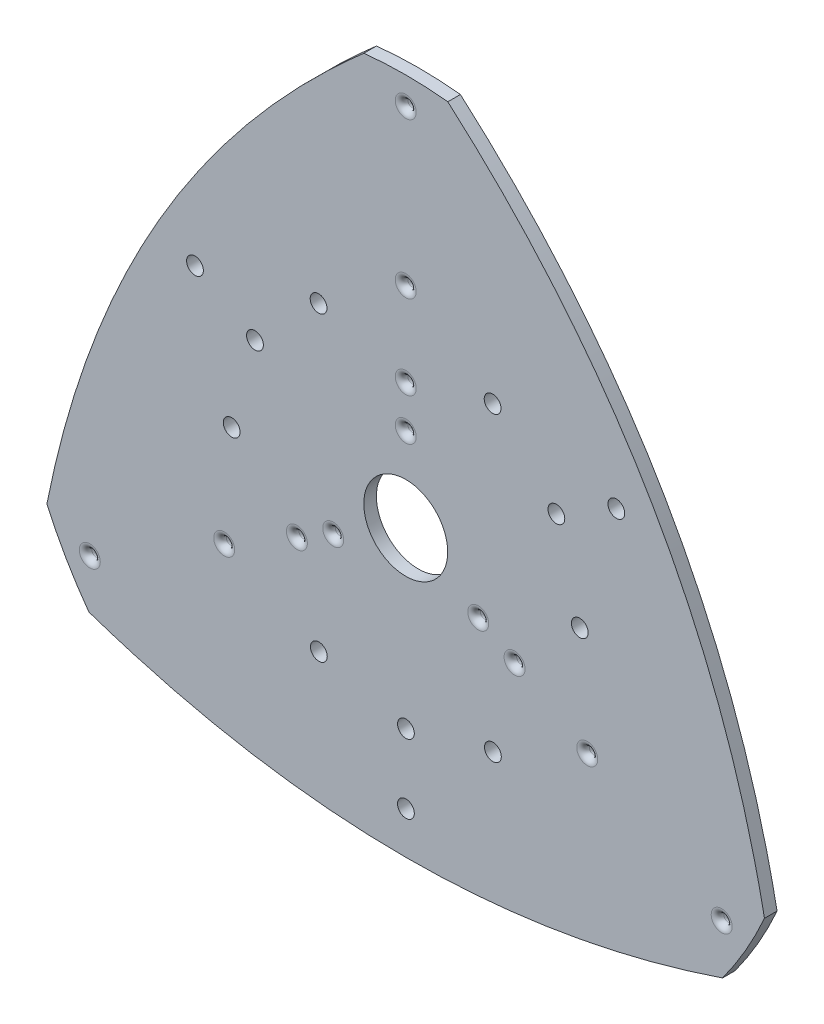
ISO-10303-21;
HEADER;
FILE_DESCRIPTION(('STEP AP214'),'2;1');
FILE_NAME('part.step','',(''),(''),'','','');
FILE_SCHEMA(('AUTOMOTIVE_DESIGN { 1 0 10303 214 1 1 1 1 }'));
ENDSEC;
DATA;
#1=APPLICATION_CONTEXT('core data for automotive mechanical design processes');
#2=APPLICATION_PROTOCOL_DEFINITION('international standard','automotive_design',2000,#1);
#3=PRODUCT_CONTEXT('',#1,'mechanical');
#4=PRODUCT('Part','Part','',(#3));
#5=PRODUCT_RELATED_PRODUCT_CATEGORY('part','',(#4));
#6=PRODUCT_DEFINITION_FORMATION('','',#4);
#7=PRODUCT_DEFINITION_CONTEXT('part definition',#1,'design');
#8=PRODUCT_DEFINITION('design','',#6,#7);
#9=PRODUCT_DEFINITION_SHAPE('','',#8);
#10=(LENGTH_UNIT() NAMED_UNIT(*) SI_UNIT(.MILLI.,.METRE.));
#11=(NAMED_UNIT(*) PLANE_ANGLE_UNIT() SI_UNIT($,.RADIAN.));
#12=(NAMED_UNIT(*) SI_UNIT($,.STERADIAN.) SOLID_ANGLE_UNIT());
#13=UNCERTAINTY_MEASURE_WITH_UNIT(LENGTH_MEASURE(1.E-05),#10,'distance_accuracy_value','');
#14=(GEOMETRIC_REPRESENTATION_CONTEXT(3) GLOBAL_UNCERTAINTY_ASSIGNED_CONTEXT((#13)) GLOBAL_UNIT_ASSIGNED_CONTEXT((#10,
#11,#12)) REPRESENTATION_CONTEXT('',''));
#15=CARTESIAN_POINT('',(0.,0.,0.));
#16=DIRECTION('',(0.,0.,1.));
#17=DIRECTION('',(1.,0.,0.));
#18=AXIS2_PLACEMENT_3D('',#15,#16,#17);
#19=CARTESIAN_POINT('',(-85.5202987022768,-37.8415178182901,3.));
#20=CARTESIAN_POINT('',(-70.011431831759,40.3956988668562,3.));
#21=CARTESIAN_POINT('',(-9.98569138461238,92.919602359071,3.));
#22=B_SPLINE_CURVE_WITH_KNOTS('',2,(#19,#20,#21),.UNSPECIFIED.,.F.,.F.,(3,3),(0.,1.),.UNSPECIFIED.);
#23=DIRECTION('',(0.,0.,-1.));
#24=VECTOR('',#23,1.);
#25=SURFACE_OF_LINEAR_EXTRUSION('',#22,#24);
#26=CARTESIAN_POINT('',(-85.5202987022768,-37.8415178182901,0.));
#27=CARTESIAN_POINT('',(-70.011431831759,40.3956988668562,0.));
#28=CARTESIAN_POINT('',(-9.98569138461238,92.919602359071,0.));
#29=B_SPLINE_CURVE_WITH_KNOTS('',2,(#26,#27,#28),.UNSPECIFIED.,.F.,.F.,(3,3),(0.,1.),.UNSPECIFIED.);
#30=CARTESIAN_POINT('',(-85.5202987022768,-37.8415178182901,0.));
#31=VERTEX_POINT('',#30);
#32=CARTESIAN_POINT('',(-9.98569138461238,92.919602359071,0.));
#33=VERTEX_POINT('',#32);
#34=EDGE_CURVE('E248',#31,#33,#29,.T.);
#35=ORIENTED_EDGE('',*,*,#34,.F.);
#36=DIRECTION('',(0.,0.,-1.));
#37=VECTOR('',#36,1.);
#38=CARTESIAN_POINT('',(-85.5202987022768,-37.8415178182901,3.));
#39=LINE('',#38,#37);
#40=CARTESIAN_POINT('',(-85.5202987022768,-37.8415178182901,3.));
#41=VERTEX_POINT('',#40);
#42=EDGE_CURVE('E95',#41,#31,#39,.T.);
#43=ORIENTED_EDGE('',*,*,#42,.F.);
#44=CARTESIAN_POINT('',(-9.98569138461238,92.919602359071,3.));
#45=VERTEX_POINT('',#44);
#46=EDGE_CURVE('E158',#41,#45,#22,.T.);
#47=ORIENTED_EDGE('',*,*,#46,.T.);
#48=DIRECTION('',(0.,0.,-1.));
#49=VECTOR('',#48,1.);
#50=CARTESIAN_POINT('',(-9.98569138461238,92.919602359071,3.));
#51=LINE('',#50,#49);
#52=EDGE_CURVE('E91',#45,#33,#51,.T.);
#53=ORIENTED_EDGE('',*,*,#52,.T.);
#54=EDGE_LOOP('',(#35,#43,#47,#53));
#55=FACE_BOUND('',#54,.T.);
#56=ADVANCED_FACE('F43',(#55),#25,.T.);
#57=CARTESIAN_POINT('',(0.,-0.0456382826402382,3.));
#58=DIRECTION('',(0.,0.,-1.));
#59=DIRECTION('',(-1.,0.,0.));
#60=AXIS2_PLACEMENT_3D('',#57,#58,#59);
#61=CYLINDRICAL_SURFACE('',#60,93.5);
#62=CARTESIAN_POINT('',(0.,-0.0456382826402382,0.));
#63=DIRECTION('',(0.,0.,1.));
#64=DIRECTION('',(1.,0.,0.));
#65=AXIS2_PLACEMENT_3D('',#62,#63,#64);
#66=CIRCLE('',#65,93.5);
#67=CARTESIAN_POINT('',(-75.5174143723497,-55.176121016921,0.));
#68=VERTEX_POINT('',#67);
#69=EDGE_CURVE('E420',#31,#68,#66,.T.);
#70=ORIENTED_EDGE('',*,*,#69,.T.);
#71=DIRECTION('',(0.,0.,-1.));
#72=VECTOR('',#71,1.);
#73=CARTESIAN_POINT('',(-75.5174143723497,-55.176121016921,3.));
#74=LINE('',#73,#72);
#75=CARTESIAN_POINT('',(-75.5174143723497,-55.176121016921,3.));
#76=VERTEX_POINT('',#75);
#77=EDGE_CURVE('E168',#76,#68,#74,.T.);
#78=ORIENTED_EDGE('',*,*,#77,.F.);
#79=CARTESIAN_POINT('',(0.,-0.0456382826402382,3.));
#80=DIRECTION('',(0.,0.,1.));
#81=DIRECTION('',(1.,0.,0.));
#82=AXIS2_PLACEMENT_3D('',#79,#80,#81);
#83=CIRCLE('',#82,93.5);
#84=EDGE_CURVE('E115',#41,#76,#83,.T.);
#85=ORIENTED_EDGE('',*,*,#84,.F.);
#86=ORIENTED_EDGE('',*,*,#42,.T.);
#87=EDGE_LOOP('',(#70,#78,#85,#86));
#88=FACE_BOUND('',#87,.T.);
#89=ADVANCED_FACE('F151',(#88),#61,.T.);
#90=CARTESIAN_POINT('',(75.4923411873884,-55.2104497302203,3.));
#91=CARTESIAN_POINT('',(-0.017509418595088,-80.8979853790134,3.));
#92=CARTESIAN_POINT('',(-75.5174143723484,-55.1761210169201,3.));
#93=B_SPLINE_CURVE_WITH_KNOTS('',2,(#90,#91,#92),.UNSPECIFIED.,.F.,.F.,(3,3),(0.,1.),.UNSPECIFIED.);
#94=DIRECTION('',(0.,0.,-1.));
#95=VECTOR('',#94,1.);
#96=SURFACE_OF_LINEAR_EXTRUSION('',#93,#95);
#97=CARTESIAN_POINT('',(75.4923411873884,-55.2104497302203,0.));
#98=CARTESIAN_POINT('',(-0.017509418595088,-80.8979853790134,0.));
#99=CARTESIAN_POINT('',(-75.5174143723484,-55.1761210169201,0.));
#100=B_SPLINE_CURVE_WITH_KNOTS('',2,(#97,#98,#99),.UNSPECIFIED.,.F.,.F.,(3,3),(0.,1.),.UNSPECIFIED.);
#101=CARTESIAN_POINT('',(75.4923411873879,-55.2104497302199,0.));
#102=VERTEX_POINT('',#101);
#103=EDGE_CURVE('E171',#102,#68,#100,.T.);
#104=ORIENTED_EDGE('',*,*,#103,.F.);
#105=DIRECTION('',(0.,0.,-1.));
#106=VECTOR('',#105,1.);
#107=CARTESIAN_POINT('',(75.4923411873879,-55.2104497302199,3.));
#108=LINE('',#107,#106);
#109=CARTESIAN_POINT('',(75.4923411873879,-55.2104497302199,3.));
#110=VERTEX_POINT('',#109);
#111=EDGE_CURVE('E124',#110,#102,#108,.T.);
#112=ORIENTED_EDGE('',*,*,#111,.F.);
#113=EDGE_CURVE('E112',#110,#76,#93,.T.);
#114=ORIENTED_EDGE('',*,*,#113,.T.);
#115=ORIENTED_EDGE('',*,*,#77,.T.);
#116=EDGE_LOOP('',(#104,#112,#114,#115));
#117=FACE_BOUND('',#116,.T.);
#118=ADVANCED_FACE('F148',(#117),#96,.T.);
#119=CARTESIAN_POINT('',(85.5031057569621,-37.8803961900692,0.));
#120=VERTEX_POINT('',#119);
#121=EDGE_CURVE('E120',#102,#120,#66,.T.);
#122=ORIENTED_EDGE('',*,*,#121,.T.);
#123=DIRECTION('',(0.,0.,-1.));
#124=VECTOR('',#123,1.);
#125=CARTESIAN_POINT('',(85.5031057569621,-37.8803961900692,3.));
#126=LINE('',#125,#124);
#127=CARTESIAN_POINT('',(85.5031057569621,-37.8803961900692,3.));
#128=VERTEX_POINT('',#127);
#129=EDGE_CURVE('E117',#128,#120,#126,.T.);
#130=ORIENTED_EDGE('',*,*,#129,.F.);
#131=EDGE_CURVE('E105',#110,#128,#83,.T.);
#132=ORIENTED_EDGE('',*,*,#131,.F.);
#133=ORIENTED_EDGE('',*,*,#111,.T.);
#134=EDGE_LOOP('',(#122,#130,#132,#133));
#135=FACE_BOUND('',#134,.T.);
#136=ADVANCED_FACE('F118',(#135),#61,.T.);
#137=CARTESIAN_POINT('',(10.0279575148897,92.9150527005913,3.));
#138=CARTESIAN_POINT('',(70.0289412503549,40.3653716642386,3.));
#139=CARTESIAN_POINT('',(85.5031057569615,-37.8803961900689,3.));
#140=B_SPLINE_CURVE_WITH_KNOTS('',2,(#137,#138,#139),.UNSPECIFIED.,.F.,.F.,(3,3),(0.,1.),.UNSPECIFIED.);
#141=DIRECTION('',(0.,0.,-1.));
#142=VECTOR('',#141,1.);
#143=SURFACE_OF_LINEAR_EXTRUSION('',#140,#142);
#144=CARTESIAN_POINT('',(10.0279575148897,92.9150527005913,0.));
#145=CARTESIAN_POINT('',(70.0289412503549,40.3653716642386,0.));
#146=CARTESIAN_POINT('',(85.5031057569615,-37.8803961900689,0.));
#147=B_SPLINE_CURVE_WITH_KNOTS('',2,(#144,#145,#146),.UNSPECIFIED.,.F.,.F.,(3,3),(0.,1.),.UNSPECIFIED.);
#148=CARTESIAN_POINT('',(10.0279575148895,92.9150527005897,0.));
#149=VERTEX_POINT('',#148);
#150=EDGE_CURVE('E429',#149,#120,#147,.T.);
#151=ORIENTED_EDGE('',*,*,#150,.F.);
#152=DIRECTION('',(0.,0.,-1.));
#153=VECTOR('',#152,1.);
#154=CARTESIAN_POINT('',(10.0279575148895,92.9150527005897,3.));
#155=LINE('',#154,#153);
#156=CARTESIAN_POINT('',(10.0279575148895,92.9150527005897,3.));
#157=VERTEX_POINT('',#156);
#158=EDGE_CURVE('E84',#157,#149,#155,.T.);
#159=ORIENTED_EDGE('',*,*,#158,.F.);
#160=EDGE_CURVE('E110',#157,#128,#140,.T.);
#161=ORIENTED_EDGE('',*,*,#160,.T.);
#162=ORIENTED_EDGE('',*,*,#129,.T.);
#163=EDGE_LOOP('',(#151,#159,#161,#162));
#164=FACE_BOUND('',#163,.T.);
#165=ADVANCED_FACE('F126',(#164),#143,.T.);
#166=CARTESIAN_POINT('',(-20.77281914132,35.9005303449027,3.));
#167=DIRECTION('',(0.,0.,-1.));
#168=DIRECTION('',(-1.,0.,0.));
#169=AXIS2_PLACEMENT_3D('',#166,#167,#168);
#170=CYLINDRICAL_SURFACE('',#169,2.);
#171=CARTESIAN_POINT('',(-20.77281914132,35.9005303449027,3.));
#172=DIRECTION('',(0.,0.,1.));
#173=DIRECTION('',(1.,0.,0.));
#174=AXIS2_PLACEMENT_3D('',#171,#172,#173);
#175=CIRCLE('',#174,2.);
#176=CARTESIAN_POINT('',(-18.77281914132,35.9005303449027,3.));
#177=VERTEX_POINT('',#176);
#178=EDGE_CURVE('E406',#177,#177,#175,.T.);
#179=ORIENTED_EDGE('',*,*,#178,.T.);
#180=EDGE_LOOP('',(#179));
#181=FACE_BOUND('',#180,.T.);
#182=CARTESIAN_POINT('',(-20.77281914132,35.9005303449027,0.));
#183=DIRECTION('',(0.,0.,1.));
#184=DIRECTION('',(1.,0.,0.));
#185=AXIS2_PLACEMENT_3D('',#182,#183,#184);
#186=CIRCLE('',#185,2.);
#187=CARTESIAN_POINT('',(-18.77281914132,35.9005303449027,0.));
#188=VERTEX_POINT('',#187);
#189=EDGE_CURVE('E162',#188,#188,#186,.T.);
#190=ORIENTED_EDGE('',*,*,#189,.F.);
#191=EDGE_LOOP('',(#190));
#192=FACE_BOUND('',#191,.T.);
#193=ADVANCED_FACE('F145',(#181,#192),#170,.F.);
#194=CARTESIAN_POINT('',(20.7043617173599,35.9400542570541,3.));
#195=DIRECTION('',(0.,0.,-1.));
#196=DIRECTION('',(-1.,0.,0.));
#197=AXIS2_PLACEMENT_3D('',#194,#195,#196);
#198=CYLINDRICAL_SURFACE('',#197,2.00000000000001);
#199=CARTESIAN_POINT('',(20.7043617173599,35.9400542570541,3.));
#200=DIRECTION('',(0.,0.,1.));
#201=DIRECTION('',(1.,0.,0.));
#202=AXIS2_PLACEMENT_3D('',#199,#200,#201);
#203=CIRCLE('',#202,2.00000000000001);
#204=CARTESIAN_POINT('',(22.7043617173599,35.9400542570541,3.));
#205=VERTEX_POINT('',#204);
#206=EDGE_CURVE('E408',#205,#205,#203,.T.);
#207=ORIENTED_EDGE('',*,*,#206,.T.);
#208=EDGE_LOOP('',(#207));
#209=FACE_BOUND('',#208,.T.);
#210=CARTESIAN_POINT('',(20.7043617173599,35.9400542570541,0.));
#211=DIRECTION('',(0.,0.,1.));
#212=DIRECTION('',(1.,0.,0.));
#213=AXIS2_PLACEMENT_3D('',#210,#211,#212);
#214=CIRCLE('',#213,2.00000000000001);
#215=CARTESIAN_POINT('',(22.7043617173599,35.9400542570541,0.));
#216=VERTEX_POINT('',#215);
#217=EDGE_CURVE('E398',#216,#216,#214,.T.);
#218=ORIENTED_EDGE('',*,*,#217,.F.);
#219=EDGE_LOOP('',(#218));
#220=FACE_BOUND('',#219,.T.);
#221=ADVANCED_FACE('F503',(#209,#220),#198,.F.);
#222=CARTESIAN_POINT('',(35.9005303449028,20.7728191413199,3.));
#223=DIRECTION('',(0.,0.,-1.));
#224=DIRECTION('',(-1.,0.,0.));
#225=AXIS2_PLACEMENT_3D('',#222,#223,#224);
#226=CYLINDRICAL_SURFACE('',#225,2.00000000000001);
#227=CARTESIAN_POINT('',(35.9005303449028,20.7728191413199,3.));
#228=DIRECTION('',(0.,0.,1.));
#229=DIRECTION('',(1.,0.,0.));
#230=AXIS2_PLACEMENT_3D('',#227,#228,#229);
#231=CIRCLE('',#230,2.00000000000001);
#232=CARTESIAN_POINT('',(37.9005303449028,20.7728191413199,3.));
#233=VERTEX_POINT('',#232);
#234=EDGE_CURVE('E413',#233,#233,#231,.T.);
#235=ORIENTED_EDGE('',*,*,#234,.T.);
#236=EDGE_LOOP('',(#235));
#237=FACE_BOUND('',#236,.T.);
#238=CARTESIAN_POINT('',(35.9005303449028,20.7728191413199,0.));
#239=DIRECTION('',(0.,0.,1.));
#240=DIRECTION('',(1.,0.,0.));
#241=AXIS2_PLACEMENT_3D('',#238,#239,#240);
#242=CIRCLE('',#241,2.00000000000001);
#243=CARTESIAN_POINT('',(37.9005303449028,20.7728191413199,0.));
#244=VERTEX_POINT('',#243);
#245=EDGE_CURVE('E394',#244,#244,#242,.T.);
#246=ORIENTED_EDGE('',*,*,#245,.F.);
#247=EDGE_LOOP('',(#246));
#248=FACE_BOUND('',#247,.T.);
#249=ADVANCED_FACE('F499',(#237,#248),#226,.F.);
#250=CARTESIAN_POINT('',(41.4771808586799,0.0395239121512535,3.));
#251=DIRECTION('',(0.,0.,-1.));
#252=DIRECTION('',(-1.,0.,0.));
#253=AXIS2_PLACEMENT_3D('',#250,#251,#252);
#254=CYLINDRICAL_SURFACE('',#253,2.00000000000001);
#255=CARTESIAN_POINT('',(41.4771808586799,0.0395239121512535,3.));
#256=DIRECTION('',(0.,0.,1.));
#257=DIRECTION('',(1.,0.,0.));
#258=AXIS2_PLACEMENT_3D('',#255,#256,#257);
#259=CIRCLE('',#258,2.00000000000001);
#260=CARTESIAN_POINT('',(43.4771808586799,0.0395239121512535,3.));
#261=VERTEX_POINT('',#260);
#262=EDGE_CURVE('E890',#261,#261,#259,.T.);
#263=ORIENTED_EDGE('',*,*,#262,.T.);
#264=EDGE_LOOP('',(#263));
#265=FACE_BOUND('',#264,.T.);
#266=CARTESIAN_POINT('',(41.4771808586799,0.0395239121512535,0.));
#267=DIRECTION('',(0.,0.,1.));
#268=DIRECTION('',(1.,0.,0.));
#269=AXIS2_PLACEMENT_3D('',#266,#267,#268);
#270=CIRCLE('',#269,2.00000000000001);
#271=CARTESIAN_POINT('',(43.4771808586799,0.0395239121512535,0.));
#272=VERTEX_POINT('',#271);
#273=EDGE_CURVE('E390',#272,#272,#270,.T.);
#274=ORIENTED_EDGE('',*,*,#273,.F.);
#275=EDGE_LOOP('',(#274));
#276=FACE_BOUND('',#275,.T.);
#277=ADVANCED_FACE('F495',(#265,#276),#254,.F.);
#278=CARTESIAN_POINT('',(20.7728191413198,-35.9005303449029,3.));
#279=DIRECTION('',(0.,0.,-1.));
#280=DIRECTION('',(-1.,0.,0.));
#281=AXIS2_PLACEMENT_3D('',#278,#279,#280);
#282=CYLINDRICAL_SURFACE('',#281,2.);
#283=CARTESIAN_POINT('',(20.7728191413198,-35.9005303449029,3.));
#284=DIRECTION('',(0.,0.,1.));
#285=DIRECTION('',(1.,0.,0.));
#286=AXIS2_PLACEMENT_3D('',#283,#284,#285);
#287=CIRCLE('',#286,2.);
#288=CARTESIAN_POINT('',(22.7728191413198,-35.9005303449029,3.));
#289=VERTEX_POINT('',#288);
#290=EDGE_CURVE('E892',#289,#289,#287,.T.);
#291=ORIENTED_EDGE('',*,*,#290,.T.);
#292=EDGE_LOOP('',(#291));
#293=FACE_BOUND('',#292,.T.);
#294=CARTESIAN_POINT('',(20.7728191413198,-35.9005303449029,0.));
#295=DIRECTION('',(0.,0.,1.));
#296=DIRECTION('',(1.,0.,0.));
#297=AXIS2_PLACEMENT_3D('',#294,#295,#296);
#298=CIRCLE('',#297,2.);
#299=CARTESIAN_POINT('',(22.7728191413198,-35.9005303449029,0.));
#300=VERTEX_POINT('',#299);
#301=EDGE_CURVE('E386',#300,#300,#298,.T.);
#302=ORIENTED_EDGE('',*,*,#301,.F.);
#303=EDGE_LOOP('',(#302));
#304=FACE_BOUND('',#303,.T.);
#305=ADVANCED_FACE('F491',(#293,#304),#282,.F.);
#306=CARTESIAN_POINT('',(0.0395239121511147,-41.4771808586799,3.));
#307=DIRECTION('',(0.,0.,-1.));
#308=DIRECTION('',(-1.,0.,0.));
#309=AXIS2_PLACEMENT_3D('',#306,#307,#308);
#310=CYLINDRICAL_SURFACE('',#309,2.00000000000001);
#311=CARTESIAN_POINT('',(0.0395239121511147,-41.4771808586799,3.));
#312=DIRECTION('',(0.,0.,1.));
#313=DIRECTION('',(1.,0.,0.));
#314=AXIS2_PLACEMENT_3D('',#311,#312,#313);
#315=CIRCLE('',#314,2.00000000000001);
#316=CARTESIAN_POINT('',(2.03952391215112,-41.4771808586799,3.));
#317=VERTEX_POINT('',#316);
#318=EDGE_CURVE('E897',#317,#317,#315,.T.);
#319=ORIENTED_EDGE('',*,*,#318,.T.);
#320=EDGE_LOOP('',(#319));
#321=FACE_BOUND('',#320,.T.);
#322=CARTESIAN_POINT('',(0.0395239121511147,-41.4771808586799,0.));
#323=DIRECTION('',(0.,0.,1.));
#324=DIRECTION('',(1.,0.,0.));
#325=AXIS2_PLACEMENT_3D('',#322,#323,#324);
#326=CIRCLE('',#325,2.00000000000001);
#327=CARTESIAN_POINT('',(2.03952391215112,-41.4771808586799,0.));
#328=VERTEX_POINT('',#327);
#329=EDGE_CURVE('E382',#328,#328,#326,.T.);
#330=ORIENTED_EDGE('',*,*,#329,.F.);
#331=EDGE_LOOP('',(#330));
#332=FACE_BOUND('',#331,.T.);
#333=ADVANCED_FACE('F487',(#321,#332),#310,.F.);
#334=CARTESIAN_POINT('',(-20.7043617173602,-35.940054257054,3.));
#335=DIRECTION('',(0.,0.,-1.));
#336=DIRECTION('',(-1.,0.,0.));
#337=AXIS2_PLACEMENT_3D('',#334,#335,#336);
#338=CYLINDRICAL_SURFACE('',#337,2.);
#339=CARTESIAN_POINT('',(-20.7043617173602,-35.940054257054,3.));
#340=DIRECTION('',(0.,0.,1.));
#341=DIRECTION('',(1.,0.,0.));
#342=AXIS2_PLACEMENT_3D('',#339,#340,#341);
#343=CIRCLE('',#342,2.);
#344=CARTESIAN_POINT('',(-18.7043617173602,-35.940054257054,3.));
#345=VERTEX_POINT('',#344);
#346=EDGE_CURVE('E900',#345,#345,#343,.T.);
#347=ORIENTED_EDGE('',*,*,#346,.T.);
#348=EDGE_LOOP('',(#347));
#349=FACE_BOUND('',#348,.T.);
#350=CARTESIAN_POINT('',(-20.7043617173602,-35.940054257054,0.));
#351=DIRECTION('',(0.,0.,1.));
#352=DIRECTION('',(1.,0.,0.));
#353=AXIS2_PLACEMENT_3D('',#350,#351,#352);
#354=CIRCLE('',#353,2.);
#355=CARTESIAN_POINT('',(-18.7043617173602,-35.940054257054,0.));
#356=VERTEX_POINT('',#355);
#357=EDGE_CURVE('E378',#356,#356,#354,.T.);
#358=ORIENTED_EDGE('',*,*,#357,.F.);
#359=EDGE_LOOP('',(#358));
#360=FACE_BOUND('',#359,.T.);
#361=ADVANCED_FACE('F483',(#349,#360),#338,.F.);
#362=CARTESIAN_POINT('',(-41.4771808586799,-0.039523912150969,3.));
#363=DIRECTION('',(0.,0.,-1.));
#364=DIRECTION('',(-1.,0.,0.));
#365=AXIS2_PLACEMENT_3D('',#362,#363,#364);
#366=CYLINDRICAL_SURFACE('',#365,2.);
#367=CARTESIAN_POINT('',(-41.4771808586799,-0.039523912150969,3.));
#368=DIRECTION('',(0.,0.,1.));
#369=DIRECTION('',(1.,0.,0.));
#370=AXIS2_PLACEMENT_3D('',#367,#368,#369);
#371=CIRCLE('',#370,2.);
#372=CARTESIAN_POINT('',(-39.4771808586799,-0.039523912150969,3.));
#373=VERTEX_POINT('',#372);
#374=EDGE_CURVE('E903',#373,#373,#371,.T.);
#375=ORIENTED_EDGE('',*,*,#374,.T.);
#376=EDGE_LOOP('',(#375));
#377=FACE_BOUND('',#376,.T.);
#378=CARTESIAN_POINT('',(-41.4771808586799,-0.039523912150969,0.));
#379=DIRECTION('',(0.,0.,1.));
#380=DIRECTION('',(1.,0.,0.));
#381=AXIS2_PLACEMENT_3D('',#378,#379,#380);
#382=CIRCLE('',#381,2.);
#383=CARTESIAN_POINT('',(-39.4771808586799,-0.039523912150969,0.));
#384=VERTEX_POINT('',#383);
#385=EDGE_CURVE('E374',#384,#384,#382,.T.);
#386=ORIENTED_EDGE('',*,*,#385,.F.);
#387=EDGE_LOOP('',(#386));
#388=FACE_BOUND('',#387,.T.);
#389=ADVANCED_FACE('F479',(#377,#388),#366,.F.);
#390=CARTESIAN_POINT('',(50.189949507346,29.0228191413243,3.));
#391=DIRECTION('',(0.,0.,-1.));
#392=DIRECTION('',(-1.,0.,0.));
#393=AXIS2_PLACEMENT_3D('',#390,#391,#392);
#394=CYLINDRICAL_SURFACE('',#393,2.00000000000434);
#395=CARTESIAN_POINT('',(50.189949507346,29.0228191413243,3.));
#396=DIRECTION('',(0.,0.,1.));
#397=DIRECTION('',(1.,0.,0.));
#398=AXIS2_PLACEMENT_3D('',#395,#396,#397);
#399=CIRCLE('',#398,2.00000000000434);
#400=CARTESIAN_POINT('',(52.1899495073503,29.0228191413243,3.));
#401=VERTEX_POINT('',#400);
#402=EDGE_CURVE('E906',#401,#401,#399,.T.);
#403=ORIENTED_EDGE('',*,*,#402,.T.);
#404=EDGE_LOOP('',(#403));
#405=FACE_BOUND('',#404,.T.);
#406=CARTESIAN_POINT('',(50.189949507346,29.0228191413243,0.));
#407=DIRECTION('',(0.,0.,1.));
#408=DIRECTION('',(1.,0.,0.));
#409=AXIS2_PLACEMENT_3D('',#406,#407,#408);
#410=CIRCLE('',#409,2.00000000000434);
#411=CARTESIAN_POINT('',(52.1899495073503,29.0228191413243,0.));
#412=VERTEX_POINT('',#411);
#413=EDGE_CURVE('E370',#412,#412,#410,.T.);
#414=ORIENTED_EDGE('',*,*,#413,.F.);
#415=EDGE_LOOP('',(#414));
#416=FACE_BOUND('',#415,.T.);
#417=ADVANCED_FACE('F475',(#405,#416),#394,.F.);
#418=CARTESIAN_POINT('',(0.0395239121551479,-57.9771808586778,3.));
#419=DIRECTION('',(0.,0.,-1.));
#420=DIRECTION('',(-1.,0.,0.));
#421=AXIS2_PLACEMENT_3D('',#418,#419,#420);
#422=CYLINDRICAL_SURFACE('',#421,2.00000000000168);
#423=CARTESIAN_POINT('',(0.0395239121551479,-57.9771808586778,3.));
#424=DIRECTION('',(0.,0.,1.));
#425=DIRECTION('',(1.,0.,0.));
#426=AXIS2_PLACEMENT_3D('',#423,#424,#425);
#427=CIRCLE('',#426,2.00000000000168);
#428=CARTESIAN_POINT('',(2.03952391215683,-57.9771808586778,3.));
#429=VERTEX_POINT('',#428);
#430=EDGE_CURVE('E909',#429,#429,#427,.T.);
#431=ORIENTED_EDGE('',*,*,#430,.T.);
#432=EDGE_LOOP('',(#431));
#433=FACE_BOUND('',#432,.T.);
#434=CARTESIAN_POINT('',(0.0395239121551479,-57.9771808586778,0.));
#435=DIRECTION('',(0.,0.,1.));
#436=DIRECTION('',(1.,0.,0.));
#437=AXIS2_PLACEMENT_3D('',#434,#435,#436);
#438=CIRCLE('',#437,2.00000000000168);
#439=CARTESIAN_POINT('',(2.03952391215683,-57.9771808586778,0.));
#440=VERTEX_POINT('',#439);
#441=EDGE_CURVE('E366',#440,#440,#438,.T.);
#442=ORIENTED_EDGE('',*,*,#441,.F.);
#443=EDGE_LOOP('',(#442));
#444=FACE_BOUND('',#443,.T.);
#445=ADVANCED_FACE('F471',(#433,#444),#422,.F.);
#446=CARTESIAN_POINT('',(0.,-0.0456382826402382,3.));
#447=DIRECTION('',(0.,0.,-1.));
#448=DIRECTION('',(-1.,0.,0.));
#449=AXIS2_PLACEMENT_3D('',#446,#447,#448);
#450=CYLINDRICAL_SURFACE('',#449,10.);
#451=CARTESIAN_POINT('',(0.,-0.0456382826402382,3.));
#452=DIRECTION('',(0.,0.,1.));
#453=DIRECTION('',(1.,0.,0.));
#454=AXIS2_PLACEMENT_3D('',#451,#452,#453);
#455=CIRCLE('',#454,10.);
#456=CARTESIAN_POINT('',(10.,-0.0456382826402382,3.));
#457=VERTEX_POINT('',#456);
#458=EDGE_CURVE('E912',#457,#457,#455,.T.);
#459=ORIENTED_EDGE('',*,*,#458,.T.);
#460=EDGE_LOOP('',(#459));
#461=FACE_BOUND('',#460,.T.);
#462=CARTESIAN_POINT('',(0.,-0.0456382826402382,0.));
#463=DIRECTION('',(0.,0.,1.));
#464=DIRECTION('',(1.,0.,0.));
#465=AXIS2_PLACEMENT_3D('',#462,#463,#464);
#466=CIRCLE('',#465,10.);
#467=CARTESIAN_POINT('',(10.,-0.0456382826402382,0.));
#468=VERTEX_POINT('',#467);
#469=EDGE_CURVE('E362',#468,#468,#466,.T.);
#470=ORIENTED_EDGE('',*,*,#469,.F.);
#471=EDGE_LOOP('',(#470));
#472=FACE_BOUND('',#471,.T.);
#473=ADVANCED_FACE('F463',(#461,#472),#450,.F.);
#474=CARTESIAN_POINT('',(-35.9400542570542,20.7043617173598,3.));
#475=DIRECTION('',(0.,0.,-1.));
#476=DIRECTION('',(-1.,0.,0.));
#477=AXIS2_PLACEMENT_3D('',#474,#475,#476);
#478=CYLINDRICAL_SURFACE('',#477,2.);
#479=CARTESIAN_POINT('',(-35.9400542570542,20.7043617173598,3.));
#480=DIRECTION('',(0.,0.,1.));
#481=DIRECTION('',(1.,0.,0.));
#482=AXIS2_PLACEMENT_3D('',#479,#480,#481);
#483=CIRCLE('',#482,2.);
#484=CARTESIAN_POINT('',(-33.9400542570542,20.7043617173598,3.));
#485=VERTEX_POINT('',#484);
#486=EDGE_CURVE('E914',#485,#485,#483,.T.);
#487=ORIENTED_EDGE('',*,*,#486,.T.);
#488=EDGE_LOOP('',(#487));
#489=FACE_BOUND('',#488,.T.);
#490=CARTESIAN_POINT('',(-35.9400542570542,20.7043617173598,0.));
#491=DIRECTION('',(0.,0.,1.));
#492=DIRECTION('',(1.,0.,0.));
#493=AXIS2_PLACEMENT_3D('',#490,#491,#492);
#494=CIRCLE('',#493,2.);
#495=CARTESIAN_POINT('',(-33.9400542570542,20.7043617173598,0.));
#496=VERTEX_POINT('',#495);
#497=EDGE_CURVE('E358',#496,#496,#494,.T.);
#498=ORIENTED_EDGE('',*,*,#497,.F.);
#499=EDGE_LOOP('',(#498));
#500=FACE_BOUND('',#499,.T.);
#501=ADVANCED_FACE('F458',(#489,#500),#478,.F.);
#502=CARTESIAN_POINT('',(-50.2294734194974,28.9543617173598,3.));
#503=DIRECTION('',(0.,0.,-1.));
#504=DIRECTION('',(-1.,0.,0.));
#505=AXIS2_PLACEMENT_3D('',#502,#503,#504);
#506=CYLINDRICAL_SURFACE('',#505,2.);
#507=CARTESIAN_POINT('',(-50.2294734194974,28.9543617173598,3.));
#508=DIRECTION('',(0.,0.,1.));
#509=DIRECTION('',(1.,0.,0.));
#510=AXIS2_PLACEMENT_3D('',#507,#508,#509);
#511=CIRCLE('',#510,2.);
#512=CARTESIAN_POINT('',(-48.2294734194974,28.9543617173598,3.));
#513=VERTEX_POINT('',#512);
#514=EDGE_CURVE('E128',#513,#513,#511,.T.);
#515=ORIENTED_EDGE('',*,*,#514,.T.);
#516=EDGE_LOOP('',(#515));
#517=FACE_BOUND('',#516,.T.);
#518=CARTESIAN_POINT('',(-50.2294734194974,28.9543617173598,0.));
#519=DIRECTION('',(0.,0.,1.));
#520=DIRECTION('',(1.,0.,0.));
#521=AXIS2_PLACEMENT_3D('',#518,#519,#520);
#522=CIRCLE('',#521,2.);
#523=CARTESIAN_POINT('',(-48.2294734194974,28.9543617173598,0.));
#524=VERTEX_POINT('',#523);
#525=EDGE_CURVE('E354',#524,#524,#522,.T.);
#526=ORIENTED_EDGE('',*,*,#525,.F.);
#527=EDGE_LOOP('',(#526));
#528=FACE_BOUND('',#527,.T.);
#529=ADVANCED_FACE('F454',(#517,#528),#506,.F.);
#530=EDGE_CURVE('E425',#149,#33,#66,.T.);
#531=ORIENTED_EDGE('',*,*,#530,.T.);
#532=ORIENTED_EDGE('',*,*,#52,.F.);
#533=EDGE_CURVE('E62',#157,#45,#83,.T.);
#534=ORIENTED_EDGE('',*,*,#533,.F.);
#535=ORIENTED_EDGE('',*,*,#158,.T.);
#536=EDGE_LOOP('',(#531,#532,#534,#535));
#537=FACE_BOUND('',#536,.T.);
#538=ADVANCED_FACE('F146',(#537),#61,.T.);
#539=CARTESIAN_POINT('',(0.,0.,3.));
#540=DIRECTION('',(0.,0.,1.));
#541=DIRECTION('',(1.,0.,0.));
#542=AXIS2_PLACEMENT_3D('',#539,#540,#541);
#543=PLANE('',#542);
#544=CARTESIAN_POINT('',(75.3046862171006,-43.4771808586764,3.));
#545=DIRECTION('',(0.,0.,1.));
#546=DIRECTION('',(1.,0.,0.));
#547=AXIS2_PLACEMENT_3D('',#544,#545,#546);
#548=CIRCLE('',#547,2.5);
#549=CARTESIAN_POINT('',(77.8046862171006,-43.4771808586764,3.));
#550=VERTEX_POINT('',#549);
#551=EDGE_CURVE('E11',#550,#550,#548,.F.);
#552=ORIENTED_EDGE('',*,*,#551,.T.);
#553=EDGE_LOOP('',(#552));
#554=FACE_BOUND('',#553,.T.);
#555=CARTESIAN_POINT('',(43.2617462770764,-24.9771808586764,3.));
#556=DIRECTION('',(0.,0.,1.));
#557=DIRECTION('',(1.,0.,0.));
#558=AXIS2_PLACEMENT_3D('',#555,#556,#557);
#559=CIRCLE('',#558,2.5);
#560=CARTESIAN_POINT('',(45.7617462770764,-24.9771808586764,3.));
#561=VERTEX_POINT('',#560);
#562=EDGE_CURVE('E53',#561,#561,#559,.F.);
#563=ORIENTED_EDGE('',*,*,#562,.T.);
#564=EDGE_LOOP('',(#563));
#565=FACE_BOUND('',#564,.T.);
#566=CARTESIAN_POINT('',(25.9412382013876,-14.9771808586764,3.));
#567=DIRECTION('',(0.,0.,1.));
#568=DIRECTION('',(1.,0.,0.));
#569=AXIS2_PLACEMENT_3D('',#566,#567,#568);
#570=CIRCLE('',#569,2.5);
#571=CARTESIAN_POINT('',(28.4412382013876,-14.9771808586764,3.));
#572=VERTEX_POINT('',#571);
#573=EDGE_CURVE('E240',#572,#572,#570,.F.);
#574=ORIENTED_EDGE('',*,*,#573,.T.);
#575=EDGE_LOOP('',(#574));
#576=FACE_BOUND('',#575,.T.);
#577=CARTESIAN_POINT('',(17.2809841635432,-9.97718085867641,3.));
#578=DIRECTION('',(0.,0.,1.));
#579=DIRECTION('',(1.,0.,0.));
#580=AXIS2_PLACEMENT_3D('',#577,#578,#579);
#581=CIRCLE('',#580,2.5);
#582=CARTESIAN_POINT('',(19.7809841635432,-9.97718085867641,3.));
#583=VERTEX_POINT('',#582);
#584=EDGE_CURVE('E237',#583,#583,#581,.F.);
#585=ORIENTED_EDGE('',*,*,#584,.T.);
#586=EDGE_LOOP('',(#585));
#587=FACE_BOUND('',#586,.T.);
#588=CARTESIAN_POINT('',(-75.3046862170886,-43.4771808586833,3.));
#589=DIRECTION('',(0.,0.,1.));
#590=DIRECTION('',(1.,0.,0.));
#591=AXIS2_PLACEMENT_3D('',#588,#589,#590);
#592=CIRCLE('',#591,2.5);
#593=CARTESIAN_POINT('',(-72.8046862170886,-43.4771808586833,3.));
#594=VERTEX_POINT('',#593);
#595=EDGE_CURVE('E234',#594,#594,#592,.F.);
#596=ORIENTED_EDGE('',*,*,#595,.T.);
#597=EDGE_LOOP('',(#596));
#598=FACE_BOUND('',#597,.T.);
#599=CARTESIAN_POINT('',(-43.2617462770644,-24.9771808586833,3.));
#600=DIRECTION('',(0.,0.,1.));
#601=DIRECTION('',(1.,0.,0.));
#602=AXIS2_PLACEMENT_3D('',#599,#600,#601);
#603=CIRCLE('',#602,2.5);
#604=CARTESIAN_POINT('',(-40.7617462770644,-24.9771808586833,3.));
#605=VERTEX_POINT('',#604);
#606=EDGE_CURVE('E231',#605,#605,#603,.F.);
#607=ORIENTED_EDGE('',*,*,#606,.T.);
#608=EDGE_LOOP('',(#607));
#609=FACE_BOUND('',#608,.T.);
#610=CARTESIAN_POINT('',(-25.9412382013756,-14.9771808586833,3.));
#611=DIRECTION('',(0.,0.,1.));
#612=DIRECTION('',(1.,0.,0.));
#613=AXIS2_PLACEMENT_3D('',#610,#611,#612);
#614=CIRCLE('',#613,2.5);
#615=CARTESIAN_POINT('',(-23.4412382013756,-14.9771808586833,3.));
#616=VERTEX_POINT('',#615);
#617=EDGE_CURVE('E228',#616,#616,#614,.F.);
#618=ORIENTED_EDGE('',*,*,#617,.T.);
#619=EDGE_LOOP('',(#618));
#620=FACE_BOUND('',#619,.T.);
#621=CARTESIAN_POINT('',(-17.2809841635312,-9.97718085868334,3.));
#622=DIRECTION('',(0.,0.,1.));
#623=DIRECTION('',(1.,0.,0.));
#624=AXIS2_PLACEMENT_3D('',#621,#622,#623);
#625=CIRCLE('',#624,2.5);
#626=CARTESIAN_POINT('',(-14.7809841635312,-9.97718085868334,3.));
#627=VERTEX_POINT('',#626);
#628=EDGE_CURVE('E225',#627,#627,#625,.F.);
#629=ORIENTED_EDGE('',*,*,#628,.T.);
#630=EDGE_LOOP('',(#629));
#631=FACE_BOUND('',#630,.T.);
#632=CARTESIAN_POINT('',(0.,19.9543617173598,3.));
#633=DIRECTION('',(0.,0.,1.));
#634=DIRECTION('',(1.,0.,0.));
#635=AXIS2_PLACEMENT_3D('',#632,#633,#634);
#636=CIRCLE('',#635,2.5);
#637=CARTESIAN_POINT('',(2.5,19.9543617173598,3.));
#638=VERTEX_POINT('',#637);
#639=EDGE_CURVE('E222',#638,#638,#636,.F.);
#640=ORIENTED_EDGE('',*,*,#639,.T.);
#641=EDGE_LOOP('',(#640));
#642=FACE_BOUND('',#641,.T.);
#643=CARTESIAN_POINT('',(0.,29.9543617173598,3.));
#644=DIRECTION('',(0.,0.,1.));
#645=DIRECTION('',(1.,0.,0.));
#646=AXIS2_PLACEMENT_3D('',#643,#644,#645);
#647=CIRCLE('',#646,2.5);
#648=CARTESIAN_POINT('',(2.5,29.9543617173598,3.));
#649=VERTEX_POINT('',#648);
#650=EDGE_CURVE('E219',#649,#649,#647,.F.);
#651=ORIENTED_EDGE('',*,*,#650,.T.);
#652=EDGE_LOOP('',(#651));
#653=FACE_BOUND('',#652,.T.);
#654=CARTESIAN_POINT('',(0.,49.9543617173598,3.));
#655=DIRECTION('',(0.,0.,1.));
#656=DIRECTION('',(1.,0.,0.));
#657=AXIS2_PLACEMENT_3D('',#654,#655,#656);
#658=CIRCLE('',#657,2.5);
#659=CARTESIAN_POINT('',(2.5,49.9543617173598,3.));
#660=VERTEX_POINT('',#659);
#661=EDGE_CURVE('E216',#660,#660,#658,.F.);
#662=ORIENTED_EDGE('',*,*,#661,.T.);
#663=EDGE_LOOP('',(#662));
#664=FACE_BOUND('',#663,.T.);
#665=CARTESIAN_POINT('',(0.,86.9543617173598,3.));
#666=DIRECTION('',(0.,0.,1.));
#667=DIRECTION('',(1.,0.,0.));
#668=AXIS2_PLACEMENT_3D('',#665,#666,#667);
#669=CIRCLE('',#668,2.5);
#670=CARTESIAN_POINT('',(2.5,86.9543617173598,3.));
#671=VERTEX_POINT('',#670);
#672=EDGE_CURVE('E213',#671,#671,#669,.F.);
#673=ORIENTED_EDGE('',*,*,#672,.T.);
#674=EDGE_LOOP('',(#673));
#675=FACE_BOUND('',#674,.T.);
#676=ORIENTED_EDGE('',*,*,#46,.F.);
#677=ORIENTED_EDGE('',*,*,#84,.T.);
#678=ORIENTED_EDGE('',*,*,#113,.F.);
#679=ORIENTED_EDGE('',*,*,#131,.T.);
#680=ORIENTED_EDGE('',*,*,#160,.F.);
#681=ORIENTED_EDGE('',*,*,#533,.T.);
#682=EDGE_LOOP('',(#676,#677,#678,#679,#680,#681));
#683=FACE_BOUND('',#682,.T.);
#684=ORIENTED_EDGE('',*,*,#514,.F.);
#685=EDGE_LOOP('',(#684));
#686=FACE_BOUND('',#685,.T.);
#687=ORIENTED_EDGE('',*,*,#486,.F.);
#688=EDGE_LOOP('',(#687));
#689=FACE_BOUND('',#688,.T.);
#690=ORIENTED_EDGE('',*,*,#458,.F.);
#691=EDGE_LOOP('',(#690));
#692=FACE_BOUND('',#691,.T.);
#693=ORIENTED_EDGE('',*,*,#430,.F.);
#694=EDGE_LOOP('',(#693));
#695=FACE_BOUND('',#694,.T.);
#696=ORIENTED_EDGE('',*,*,#402,.F.);
#697=EDGE_LOOP('',(#696));
#698=FACE_BOUND('',#697,.T.);
#699=ORIENTED_EDGE('',*,*,#374,.F.);
#700=EDGE_LOOP('',(#699));
#701=FACE_BOUND('',#700,.T.);
#702=ORIENTED_EDGE('',*,*,#346,.F.);
#703=EDGE_LOOP('',(#702));
#704=FACE_BOUND('',#703,.T.);
#705=ORIENTED_EDGE('',*,*,#318,.F.);
#706=EDGE_LOOP('',(#705));
#707=FACE_BOUND('',#706,.T.);
#708=ORIENTED_EDGE('',*,*,#290,.F.);
#709=EDGE_LOOP('',(#708));
#710=FACE_BOUND('',#709,.T.);
#711=ORIENTED_EDGE('',*,*,#262,.F.);
#712=EDGE_LOOP('',(#711));
#713=FACE_BOUND('',#712,.T.);
#714=ORIENTED_EDGE('',*,*,#234,.F.);
#715=EDGE_LOOP('',(#714));
#716=FACE_BOUND('',#715,.T.);
#717=ORIENTED_EDGE('',*,*,#206,.F.);
#718=EDGE_LOOP('',(#717));
#719=FACE_BOUND('',#718,.T.);
#720=ORIENTED_EDGE('',*,*,#178,.F.);
#721=EDGE_LOOP('',(#720));
#722=FACE_BOUND('',#721,.T.);
#723=ADVANCED_FACE('F107',(#554,#565,#576,#587,#598,#609,#620,#631,#642,#653,#664,#675,#683,
#686,#689,#692,#695,#698,#701,#704,#707,#710,#713,#716,#719,#722),#543,.T.);
#724=CARTESIAN_POINT('',(0.,0.,0.));
#725=DIRECTION('',(0.,0.,1.));
#726=DIRECTION('',(1.,0.,0.));
#727=AXIS2_PLACEMENT_3D('',#724,#725,#726);
#728=PLANE('',#727);
#729=CARTESIAN_POINT('',(75.3046862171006,-43.4771808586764,0.));
#730=DIRECTION('',(0.,0.,1.));
#731=DIRECTION('',(1.,0.,0.));
#732=AXIS2_PLACEMENT_3D('',#729,#730,#731);
#733=CIRCLE('',#732,2.5);
#734=CARTESIAN_POINT('',(77.8046862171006,-43.4771808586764,0.));
#735=VERTEX_POINT('',#734);
#736=EDGE_CURVE('E210',#735,#735,#733,.T.);
#737=ORIENTED_EDGE('',*,*,#736,.T.);
#738=EDGE_LOOP('',(#737));
#739=FACE_BOUND('',#738,.T.);
#740=CARTESIAN_POINT('',(43.2617462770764,-24.9771808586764,0.));
#741=DIRECTION('',(0.,0.,1.));
#742=DIRECTION('',(1.,0.,0.));
#743=AXIS2_PLACEMENT_3D('',#740,#741,#742);
#744=CIRCLE('',#743,2.5);
#745=CARTESIAN_POINT('',(45.7617462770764,-24.9771808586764,0.));
#746=VERTEX_POINT('',#745);
#747=EDGE_CURVE('E207',#746,#746,#744,.T.);
#748=ORIENTED_EDGE('',*,*,#747,.T.);
#749=EDGE_LOOP('',(#748));
#750=FACE_BOUND('',#749,.T.);
#751=CARTESIAN_POINT('',(25.9412382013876,-14.9771808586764,0.));
#752=DIRECTION('',(0.,0.,1.));
#753=DIRECTION('',(1.,0.,0.));
#754=AXIS2_PLACEMENT_3D('',#751,#752,#753);
#755=CIRCLE('',#754,2.5);
#756=CARTESIAN_POINT('',(28.4412382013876,-14.9771808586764,0.));
#757=VERTEX_POINT('',#756);
#758=EDGE_CURVE('E204',#757,#757,#755,.T.);
#759=ORIENTED_EDGE('',*,*,#758,.T.);
#760=EDGE_LOOP('',(#759));
#761=FACE_BOUND('',#760,.T.);
#762=CARTESIAN_POINT('',(17.2809841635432,-9.97718085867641,0.));
#763=DIRECTION('',(0.,0.,1.));
#764=DIRECTION('',(1.,0.,0.));
#765=AXIS2_PLACEMENT_3D('',#762,#763,#764);
#766=CIRCLE('',#765,2.5);
#767=CARTESIAN_POINT('',(19.7809841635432,-9.97718085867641,0.));
#768=VERTEX_POINT('',#767);
#769=EDGE_CURVE('E201',#768,#768,#766,.T.);
#770=ORIENTED_EDGE('',*,*,#769,.T.);
#771=EDGE_LOOP('',(#770));
#772=FACE_BOUND('',#771,.T.);
#773=CARTESIAN_POINT('',(0.,86.9543617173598,0.));
#774=DIRECTION('',(0.,0.,1.));
#775=DIRECTION('',(1.,0.,0.));
#776=AXIS2_PLACEMENT_3D('',#773,#774,#775);
#777=CIRCLE('',#776,2.5);
#778=CARTESIAN_POINT('',(2.5,86.9543617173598,0.));
#779=VERTEX_POINT('',#778);
#780=EDGE_CURVE('E198',#779,#779,#777,.T.);
#781=ORIENTED_EDGE('',*,*,#780,.T.);
#782=EDGE_LOOP('',(#781));
#783=FACE_BOUND('',#782,.T.);
#784=CARTESIAN_POINT('',(0.,49.9543617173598,0.));
#785=DIRECTION('',(0.,0.,1.));
#786=DIRECTION('',(1.,0.,0.));
#787=AXIS2_PLACEMENT_3D('',#784,#785,#786);
#788=CIRCLE('',#787,2.5);
#789=CARTESIAN_POINT('',(2.5,49.9543617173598,0.));
#790=VERTEX_POINT('',#789);
#791=EDGE_CURVE('E195',#790,#790,#788,.T.);
#792=ORIENTED_EDGE('',*,*,#791,.T.);
#793=EDGE_LOOP('',(#792));
#794=FACE_BOUND('',#793,.T.);
#795=CARTESIAN_POINT('',(0.,29.9543617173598,0.));
#796=DIRECTION('',(0.,0.,1.));
#797=DIRECTION('',(1.,0.,0.));
#798=AXIS2_PLACEMENT_3D('',#795,#796,#797);
#799=CIRCLE('',#798,2.5);
#800=CARTESIAN_POINT('',(2.5,29.9543617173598,0.));
#801=VERTEX_POINT('',#800);
#802=EDGE_CURVE('E192',#801,#801,#799,.T.);
#803=ORIENTED_EDGE('',*,*,#802,.T.);
#804=EDGE_LOOP('',(#803));
#805=FACE_BOUND('',#804,.T.);
#806=CARTESIAN_POINT('',(0.,19.9543617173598,0.));
#807=DIRECTION('',(0.,0.,1.));
#808=DIRECTION('',(1.,0.,0.));
#809=AXIS2_PLACEMENT_3D('',#806,#807,#808);
#810=CIRCLE('',#809,2.5);
#811=CARTESIAN_POINT('',(2.5,19.9543617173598,0.));
#812=VERTEX_POINT('',#811);
#813=EDGE_CURVE('E189',#812,#812,#810,.T.);
#814=ORIENTED_EDGE('',*,*,#813,.T.);
#815=EDGE_LOOP('',(#814));
#816=FACE_BOUND('',#815,.T.);
#817=CARTESIAN_POINT('',(-17.2809841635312,-9.97718085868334,0.));
#818=DIRECTION('',(0.,0.,1.));
#819=DIRECTION('',(1.,0.,0.));
#820=AXIS2_PLACEMENT_3D('',#817,#818,#819);
#821=CIRCLE('',#820,2.5);
#822=CARTESIAN_POINT('',(-14.7809841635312,-9.97718085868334,0.));
#823=VERTEX_POINT('',#822);
#824=EDGE_CURVE('E186',#823,#823,#821,.T.);
#825=ORIENTED_EDGE('',*,*,#824,.T.);
#826=EDGE_LOOP('',(#825));
#827=FACE_BOUND('',#826,.T.);
#828=CARTESIAN_POINT('',(-25.9412382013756,-14.9771808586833,0.));
#829=DIRECTION('',(0.,0.,1.));
#830=DIRECTION('',(1.,0.,0.));
#831=AXIS2_PLACEMENT_3D('',#828,#829,#830);
#832=CIRCLE('',#831,2.5);
#833=CARTESIAN_POINT('',(-23.4412382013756,-14.9771808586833,0.));
#834=VERTEX_POINT('',#833);
#835=EDGE_CURVE('E183',#834,#834,#832,.T.);
#836=ORIENTED_EDGE('',*,*,#835,.T.);
#837=EDGE_LOOP('',(#836));
#838=FACE_BOUND('',#837,.T.);
#839=CARTESIAN_POINT('',(-43.2617462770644,-24.9771808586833,0.));
#840=DIRECTION('',(0.,0.,1.));
#841=DIRECTION('',(1.,0.,0.));
#842=AXIS2_PLACEMENT_3D('',#839,#840,#841);
#843=CIRCLE('',#842,2.5);
#844=CARTESIAN_POINT('',(-40.7617462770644,-24.9771808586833,0.));
#845=VERTEX_POINT('',#844);
#846=EDGE_CURVE('E180',#845,#845,#843,.T.);
#847=ORIENTED_EDGE('',*,*,#846,.T.);
#848=EDGE_LOOP('',(#847));
#849=FACE_BOUND('',#848,.T.);
#850=CARTESIAN_POINT('',(-75.3046862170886,-43.4771808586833,0.));
#851=DIRECTION('',(0.,0.,1.));
#852=DIRECTION('',(1.,0.,0.));
#853=AXIS2_PLACEMENT_3D('',#850,#851,#852);
#854=CIRCLE('',#853,2.5);
#855=CARTESIAN_POINT('',(-72.8046862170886,-43.4771808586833,0.));
#856=VERTEX_POINT('',#855);
#857=EDGE_CURVE('E177',#856,#856,#854,.T.);
#858=ORIENTED_EDGE('',*,*,#857,.T.);
#859=EDGE_LOOP('',(#858));
#860=FACE_BOUND('',#859,.T.);
#861=ORIENTED_EDGE('',*,*,#34,.T.);
#862=ORIENTED_EDGE('',*,*,#530,.F.);
#863=ORIENTED_EDGE('',*,*,#150,.T.);
#864=ORIENTED_EDGE('',*,*,#121,.F.);
#865=ORIENTED_EDGE('',*,*,#103,.T.);
#866=ORIENTED_EDGE('',*,*,#69,.F.);
#867=EDGE_LOOP('',(#861,#862,#863,#864,#865,#866));
#868=FACE_BOUND('',#867,.T.);
#869=ORIENTED_EDGE('',*,*,#525,.T.);
#870=EDGE_LOOP('',(#869));
#871=FACE_BOUND('',#870,.T.);
#872=ORIENTED_EDGE('',*,*,#497,.T.);
#873=EDGE_LOOP('',(#872));
#874=FACE_BOUND('',#873,.T.);
#875=ORIENTED_EDGE('',*,*,#469,.T.);
#876=EDGE_LOOP('',(#875));
#877=FACE_BOUND('',#876,.T.);
#878=ORIENTED_EDGE('',*,*,#441,.T.);
#879=EDGE_LOOP('',(#878));
#880=FACE_BOUND('',#879,.T.);
#881=ORIENTED_EDGE('',*,*,#413,.T.);
#882=EDGE_LOOP('',(#881));
#883=FACE_BOUND('',#882,.T.);
#884=ORIENTED_EDGE('',*,*,#385,.T.);
#885=EDGE_LOOP('',(#884));
#886=FACE_BOUND('',#885,.T.);
#887=ORIENTED_EDGE('',*,*,#357,.T.);
#888=EDGE_LOOP('',(#887));
#889=FACE_BOUND('',#888,.T.);
#890=ORIENTED_EDGE('',*,*,#329,.T.);
#891=EDGE_LOOP('',(#890));
#892=FACE_BOUND('',#891,.T.);
#893=ORIENTED_EDGE('',*,*,#301,.T.);
#894=EDGE_LOOP('',(#893));
#895=FACE_BOUND('',#894,.T.);
#896=ORIENTED_EDGE('',*,*,#273,.T.);
#897=EDGE_LOOP('',(#896));
#898=FACE_BOUND('',#897,.T.);
#899=ORIENTED_EDGE('',*,*,#245,.T.);
#900=EDGE_LOOP('',(#899));
#901=FACE_BOUND('',#900,.T.);
#902=ORIENTED_EDGE('',*,*,#217,.T.);
#903=EDGE_LOOP('',(#902));
#904=FACE_BOUND('',#903,.T.);
#905=ORIENTED_EDGE('',*,*,#189,.T.);
#906=EDGE_LOOP('',(#905));
#907=FACE_BOUND('',#906,.T.);
#908=ADVANCED_FACE('F298',(#739,#750,#761,#772,#783,#794,#805,#816,#827,#838,#849,#860,#868,
#871,#874,#877,#880,#883,#886,#889,#892,#895,#898,#901,#904,#907),#728,.F.);
#909=CARTESIAN_POINT('',(75.3046862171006,-43.4771808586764,1.5));
#910=DIRECTION('',(0.,0.,1.));
#911=DIRECTION('',(1.,0.,0.));
#912=AXIS2_PLACEMENT_3D('',#909,#910,#911);
#913=TOROIDAL_SURFACE('',#912,2.5,1.5);
#914=ORIENTED_EDGE('',*,*,#551,.F.);
#915=EDGE_LOOP('',(#914));
#916=FACE_BOUND('',#915,.T.);
#917=CARTESIAN_POINT('',(75.3046862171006,-43.4771808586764,1.5));
#918=DIRECTION('',(0.,0.,1.));
#919=DIRECTION('',(1.,0.,0.));
#920=AXIS2_PLACEMENT_3D('',#917,#918,#919);
#921=CIRCLE('',#920,0.999999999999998);
#922=CARTESIAN_POINT('',(76.3046862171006,-43.4771808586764,1.5));
#923=VERTEX_POINT('',#922);
#924=EDGE_CURVE('E245',#923,#923,#921,.T.);
#925=ORIENTED_EDGE('',*,*,#924,.F.);
#926=EDGE_LOOP('',(#925));
#927=FACE_BOUND('',#926,.T.);
#928=ADVANCED_FACE('F331',(#916,#927),#913,.T.);
#929=CARTESIAN_POINT('',(75.3046862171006,-43.4771808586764,1.5));
#930=DIRECTION('',(0.,0.,1.));
#931=DIRECTION('',(1.,0.,0.));
#932=AXIS2_PLACEMENT_3D('',#929,#930,#931);
#933=TOROIDAL_SURFACE('',#932,2.5,1.5);
#934=ORIENTED_EDGE('',*,*,#924,.T.);
#935=EDGE_LOOP('',(#934));
#936=FACE_BOUND('',#935,.T.);
#937=ORIENTED_EDGE('',*,*,#736,.F.);
#938=EDGE_LOOP('',(#937));
#939=FACE_BOUND('',#938,.T.);
#940=ADVANCED_FACE('F156',(#936,#939),#933,.T.);
#941=CARTESIAN_POINT('',(43.2617462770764,-24.9771808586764,1.5));
#942=DIRECTION('',(0.,0.,1.));
#943=DIRECTION('',(1.,0.,0.));
#944=AXIS2_PLACEMENT_3D('',#941,#942,#943);
#945=TOROIDAL_SURFACE('',#944,2.5,1.5);
#946=ORIENTED_EDGE('',*,*,#562,.F.);
#947=EDGE_LOOP('',(#946));
#948=FACE_BOUND('',#947,.T.);
#949=CARTESIAN_POINT('',(43.2617462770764,-24.9771808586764,1.5));
#950=DIRECTION('',(0.,0.,1.));
#951=DIRECTION('',(1.,0.,0.));
#952=AXIS2_PLACEMENT_3D('',#949,#950,#951);
#953=CIRCLE('',#952,0.999999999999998);
#954=CARTESIAN_POINT('',(44.2617462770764,-24.9771808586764,1.5));
#955=VERTEX_POINT('',#954);
#956=EDGE_CURVE('E249',#955,#955,#953,.T.);
#957=ORIENTED_EDGE('',*,*,#956,.F.);
#958=EDGE_LOOP('',(#957));
#959=FACE_BOUND('',#958,.T.);
#960=ADVANCED_FACE('F606',(#948,#959),#945,.T.);
#961=CARTESIAN_POINT('',(43.2617462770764,-24.9771808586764,1.5));
#962=DIRECTION('',(0.,0.,1.));
#963=DIRECTION('',(1.,0.,0.));
#964=AXIS2_PLACEMENT_3D('',#961,#962,#963);
#965=TOROIDAL_SURFACE('',#964,2.5,1.5);
#966=ORIENTED_EDGE('',*,*,#956,.T.);
#967=EDGE_LOOP('',(#966));
#968=FACE_BOUND('',#967,.T.);
#969=ORIENTED_EDGE('',*,*,#747,.F.);
#970=EDGE_LOOP('',(#969));
#971=FACE_BOUND('',#970,.T.);
#972=ADVANCED_FACE('F615',(#968,#971),#965,.T.);
#973=CARTESIAN_POINT('',(25.9412382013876,-14.9771808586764,1.5));
#974=DIRECTION('',(0.,0.,1.));
#975=DIRECTION('',(1.,0.,0.));
#976=AXIS2_PLACEMENT_3D('',#973,#974,#975);
#977=TOROIDAL_SURFACE('',#976,2.5,1.5);
#978=ORIENTED_EDGE('',*,*,#573,.F.);
#979=EDGE_LOOP('',(#978));
#980=FACE_BOUND('',#979,.T.);
#981=CARTESIAN_POINT('',(25.9412382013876,-14.9771808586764,1.5));
#982=DIRECTION('',(0.,0.,1.));
#983=DIRECTION('',(1.,0.,0.));
#984=AXIS2_PLACEMENT_3D('',#981,#982,#983);
#985=CIRCLE('',#984,1.);
#986=CARTESIAN_POINT('',(26.9412382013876,-14.9771808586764,1.5));
#987=VERTEX_POINT('',#986);
#988=EDGE_CURVE('E252',#987,#987,#985,.T.);
#989=ORIENTED_EDGE('',*,*,#988,.F.);
#990=EDGE_LOOP('',(#989));
#991=FACE_BOUND('',#990,.T.);
#992=ADVANCED_FACE('F625',(#980,#991),#977,.T.);
#993=CARTESIAN_POINT('',(25.9412382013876,-14.9771808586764,1.5));
#994=DIRECTION('',(0.,0.,1.));
#995=DIRECTION('',(1.,0.,0.));
#996=AXIS2_PLACEMENT_3D('',#993,#994,#995);
#997=TOROIDAL_SURFACE('',#996,2.5,1.5);
#998=ORIENTED_EDGE('',*,*,#988,.T.);
#999=EDGE_LOOP('',(#998));
#1000=FACE_BOUND('',#999,.T.);
#1001=ORIENTED_EDGE('',*,*,#758,.F.);
#1002=EDGE_LOOP('',(#1001));
#1003=FACE_BOUND('',#1002,.T.);
#1004=ADVANCED_FACE('F635',(#1000,#1003),#997,.T.);
#1005=CARTESIAN_POINT('',(17.2809841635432,-9.97718085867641,1.5));
#1006=DIRECTION('',(0.,0.,1.));
#1007=DIRECTION('',(1.,0.,0.));
#1008=AXIS2_PLACEMENT_3D('',#1005,#1006,#1007);
#1009=TOROIDAL_SURFACE('',#1008,2.5,1.5);
#1010=ORIENTED_EDGE('',*,*,#584,.F.);
#1011=EDGE_LOOP('',(#1010));
#1012=FACE_BOUND('',#1011,.T.);
#1013=CARTESIAN_POINT('',(17.2809841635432,-9.97718085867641,1.5));
#1014=DIRECTION('',(0.,0.,1.));
#1015=DIRECTION('',(1.,0.,0.));
#1016=AXIS2_PLACEMENT_3D('',#1013,#1014,#1015);
#1017=CIRCLE('',#1016,1.);
#1018=CARTESIAN_POINT('',(18.2809841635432,-9.97718085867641,1.5));
#1019=VERTEX_POINT('',#1018);
#1020=EDGE_CURVE('E255',#1019,#1019,#1017,.T.);
#1021=ORIENTED_EDGE('',*,*,#1020,.F.);
#1022=EDGE_LOOP('',(#1021));
#1023=FACE_BOUND('',#1022,.T.);
#1024=ADVANCED_FACE('F645',(#1012,#1023),#1009,.T.);
#1025=CARTESIAN_POINT('',(17.2809841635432,-9.97718085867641,1.5));
#1026=DIRECTION('',(0.,0.,1.));
#1027=DIRECTION('',(1.,0.,0.));
#1028=AXIS2_PLACEMENT_3D('',#1025,#1026,#1027);
#1029=TOROIDAL_SURFACE('',#1028,2.5,1.5);
#1030=ORIENTED_EDGE('',*,*,#1020,.T.);
#1031=EDGE_LOOP('',(#1030));
#1032=FACE_BOUND('',#1031,.T.);
#1033=ORIENTED_EDGE('',*,*,#769,.F.);
#1034=EDGE_LOOP('',(#1033));
#1035=FACE_BOUND('',#1034,.T.);
#1036=ADVANCED_FACE('F319',(#1032,#1035),#1029,.T.);
#1037=CARTESIAN_POINT('',(0.,86.9543617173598,1.5));
#1038=DIRECTION('',(0.,0.,1.));
#1039=DIRECTION('',(1.,0.,0.));
#1040=AXIS2_PLACEMENT_3D('',#1037,#1038,#1039);
#1041=TOROIDAL_SURFACE('',#1040,2.5,1.5);
#1042=ORIENTED_EDGE('',*,*,#672,.F.);
#1043=EDGE_LOOP('',(#1042));
#1044=FACE_BOUND('',#1043,.T.);
#1045=CARTESIAN_POINT('',(0.,86.9543617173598,1.5));
#1046=DIRECTION('',(0.,0.,1.));
#1047=DIRECTION('',(1.,0.,0.));
#1048=AXIS2_PLACEMENT_3D('',#1045,#1046,#1047);
#1049=CIRCLE('',#1048,1.);
#1050=CARTESIAN_POINT('',(1.,86.9543617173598,1.5));
#1051=VERTEX_POINT('',#1050);
#1052=EDGE_CURVE('E258',#1051,#1051,#1049,.T.);
#1053=ORIENTED_EDGE('',*,*,#1052,.F.);
#1054=EDGE_LOOP('',(#1053));
#1055=FACE_BOUND('',#1054,.T.);
#1056=ADVANCED_FACE('F315',(#1044,#1055),#1041,.T.);
#1057=CARTESIAN_POINT('',(0.,86.9543617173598,1.5));
#1058=DIRECTION('',(0.,0.,1.));
#1059=DIRECTION('',(1.,0.,0.));
#1060=AXIS2_PLACEMENT_3D('',#1057,#1058,#1059);
#1061=TOROIDAL_SURFACE('',#1060,2.5,1.5);
#1062=ORIENTED_EDGE('',*,*,#1052,.T.);
#1063=EDGE_LOOP('',(#1062));
#1064=FACE_BOUND('',#1063,.T.);
#1065=ORIENTED_EDGE('',*,*,#780,.F.);
#1066=EDGE_LOOP('',(#1065));
#1067=FACE_BOUND('',#1066,.T.);
#1068=ADVANCED_FACE('F318',(#1064,#1067),#1061,.T.);
#1069=CARTESIAN_POINT('',(0.,49.9543617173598,1.5));
#1070=DIRECTION('',(0.,0.,1.));
#1071=DIRECTION('',(1.,0.,0.));
#1072=AXIS2_PLACEMENT_3D('',#1069,#1070,#1071);
#1073=TOROIDAL_SURFACE('',#1072,2.5,1.5);
#1074=ORIENTED_EDGE('',*,*,#661,.F.);
#1075=EDGE_LOOP('',(#1074));
#1076=FACE_BOUND('',#1075,.T.);
#1077=CARTESIAN_POINT('',(0.,49.9543617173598,1.5));
#1078=DIRECTION('',(0.,0.,1.));
#1079=DIRECTION('',(1.,0.,0.));
#1080=AXIS2_PLACEMENT_3D('',#1077,#1078,#1079);
#1081=CIRCLE('',#1080,1.);
#1082=CARTESIAN_POINT('',(1.,49.9543617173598,1.5));
#1083=VERTEX_POINT('',#1082);
#1084=EDGE_CURVE('E261',#1083,#1083,#1081,.T.);
#1085=ORIENTED_EDGE('',*,*,#1084,.F.);
#1086=EDGE_LOOP('',(#1085));
#1087=FACE_BOUND('',#1086,.T.);
#1088=ADVANCED_FACE('F325',(#1076,#1087),#1073,.T.);
#1089=CARTESIAN_POINT('',(0.,49.9543617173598,1.5));
#1090=DIRECTION('',(0.,0.,1.));
#1091=DIRECTION('',(1.,0.,0.));
#1092=AXIS2_PLACEMENT_3D('',#1089,#1090,#1091);
#1093=TOROIDAL_SURFACE('',#1092,2.5,1.5);
#1094=ORIENTED_EDGE('',*,*,#1084,.T.);
#1095=EDGE_LOOP('',(#1094));
#1096=FACE_BOUND('',#1095,.T.);
#1097=ORIENTED_EDGE('',*,*,#791,.F.);
#1098=EDGE_LOOP('',(#1097));
#1099=FACE_BOUND('',#1098,.T.);
#1100=ADVANCED_FACE('F685',(#1096,#1099),#1093,.T.);
#1101=CARTESIAN_POINT('',(0.,29.9543617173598,1.5));
#1102=DIRECTION('',(0.,0.,1.));
#1103=DIRECTION('',(1.,0.,0.));
#1104=AXIS2_PLACEMENT_3D('',#1101,#1102,#1103);
#1105=TOROIDAL_SURFACE('',#1104,2.5,1.5);
#1106=ORIENTED_EDGE('',*,*,#650,.F.);
#1107=EDGE_LOOP('',(#1106));
#1108=FACE_BOUND('',#1107,.T.);
#1109=CARTESIAN_POINT('',(0.,29.9543617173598,1.5));
#1110=DIRECTION('',(0.,0.,1.));
#1111=DIRECTION('',(1.,0.,0.));
#1112=AXIS2_PLACEMENT_3D('',#1109,#1110,#1111);
#1113=CIRCLE('',#1112,1.);
#1114=CARTESIAN_POINT('',(1.,29.9543617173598,1.5));
#1115=VERTEX_POINT('',#1114);
#1116=EDGE_CURVE('E264',#1115,#1115,#1113,.T.);
#1117=ORIENTED_EDGE('',*,*,#1116,.F.);
#1118=EDGE_LOOP('',(#1117));
#1119=FACE_BOUND('',#1118,.T.);
#1120=ADVANCED_FACE('F695',(#1108,#1119),#1105,.T.);
#1121=CARTESIAN_POINT('',(0.,29.9543617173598,1.5));
#1122=DIRECTION('',(0.,0.,1.));
#1123=DIRECTION('',(1.,0.,0.));
#1124=AXIS2_PLACEMENT_3D('',#1121,#1122,#1123);
#1125=TOROIDAL_SURFACE('',#1124,2.5,1.5);
#1126=ORIENTED_EDGE('',*,*,#1116,.T.);
#1127=EDGE_LOOP('',(#1126));
#1128=FACE_BOUND('',#1127,.T.);
#1129=ORIENTED_EDGE('',*,*,#802,.F.);
#1130=EDGE_LOOP('',(#1129));
#1131=FACE_BOUND('',#1130,.T.);
#1132=ADVANCED_FACE('F705',(#1128,#1131),#1125,.T.);
#1133=CARTESIAN_POINT('',(0.,19.9543617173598,1.5));
#1134=DIRECTION('',(0.,0.,1.));
#1135=DIRECTION('',(1.,0.,0.));
#1136=AXIS2_PLACEMENT_3D('',#1133,#1134,#1135);
#1137=TOROIDAL_SURFACE('',#1136,2.5,1.5);
#1138=ORIENTED_EDGE('',*,*,#639,.F.);
#1139=EDGE_LOOP('',(#1138));
#1140=FACE_BOUND('',#1139,.T.);
#1141=CARTESIAN_POINT('',(0.,19.9543617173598,1.5));
#1142=DIRECTION('',(0.,0.,1.));
#1143=DIRECTION('',(1.,0.,0.));
#1144=AXIS2_PLACEMENT_3D('',#1141,#1142,#1143);
#1145=CIRCLE('',#1144,1.);
#1146=CARTESIAN_POINT('',(1.,19.9543617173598,1.5));
#1147=VERTEX_POINT('',#1146);
#1148=EDGE_CURVE('E267',#1147,#1147,#1145,.T.);
#1149=ORIENTED_EDGE('',*,*,#1148,.F.);
#1150=EDGE_LOOP('',(#1149));
#1151=FACE_BOUND('',#1150,.T.);
#1152=ADVANCED_FACE('F715',(#1140,#1151),#1137,.T.);
#1153=CARTESIAN_POINT('',(0.,19.9543617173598,1.5));
#1154=DIRECTION('',(0.,0.,1.));
#1155=DIRECTION('',(1.,0.,0.));
#1156=AXIS2_PLACEMENT_3D('',#1153,#1154,#1155);
#1157=TOROIDAL_SURFACE('',#1156,2.5,1.5);
#1158=ORIENTED_EDGE('',*,*,#1148,.T.);
#1159=EDGE_LOOP('',(#1158));
#1160=FACE_BOUND('',#1159,.T.);
#1161=ORIENTED_EDGE('',*,*,#813,.F.);
#1162=EDGE_LOOP('',(#1161));
#1163=FACE_BOUND('',#1162,.T.);
#1164=ADVANCED_FACE('F725',(#1160,#1163),#1157,.T.);
#1165=CARTESIAN_POINT('',(-17.2809841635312,-9.97718085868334,1.5));
#1166=DIRECTION('',(0.,0.,1.));
#1167=DIRECTION('',(1.,0.,0.));
#1168=AXIS2_PLACEMENT_3D('',#1165,#1166,#1167);
#1169=TOROIDAL_SURFACE('',#1168,2.5,1.5);
#1170=ORIENTED_EDGE('',*,*,#628,.F.);
#1171=EDGE_LOOP('',(#1170));
#1172=FACE_BOUND('',#1171,.T.);
#1173=CARTESIAN_POINT('',(-17.2809841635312,-9.97718085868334,1.5));
#1174=DIRECTION('',(0.,0.,1.));
#1175=DIRECTION('',(1.,0.,0.));
#1176=AXIS2_PLACEMENT_3D('',#1173,#1174,#1175);
#1177=CIRCLE('',#1176,1.);
#1178=CARTESIAN_POINT('',(-16.2809841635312,-9.97718085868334,1.5));
#1179=VERTEX_POINT('',#1178);
#1180=EDGE_CURVE('E270',#1179,#1179,#1177,.T.);
#1181=ORIENTED_EDGE('',*,*,#1180,.F.);
#1182=EDGE_LOOP('',(#1181));
#1183=FACE_BOUND('',#1182,.T.);
#1184=ADVANCED_FACE('F735',(#1172,#1183),#1169,.T.);
#1185=CARTESIAN_POINT('',(-17.2809841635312,-9.97718085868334,1.5));
#1186=DIRECTION('',(0.,0.,1.));
#1187=DIRECTION('',(1.,0.,0.));
#1188=AXIS2_PLACEMENT_3D('',#1185,#1186,#1187);
#1189=TOROIDAL_SURFACE('',#1188,2.5,1.5);
#1190=ORIENTED_EDGE('',*,*,#1180,.T.);
#1191=EDGE_LOOP('',(#1190));
#1192=FACE_BOUND('',#1191,.T.);
#1193=ORIENTED_EDGE('',*,*,#824,.F.);
#1194=EDGE_LOOP('',(#1193));
#1195=FACE_BOUND('',#1194,.T.);
#1196=ADVANCED_FACE('F745',(#1192,#1195),#1189,.T.);
#1197=CARTESIAN_POINT('',(-25.9412382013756,-14.9771808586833,1.5));
#1198=DIRECTION('',(0.,0.,1.));
#1199=DIRECTION('',(1.,0.,0.));
#1200=AXIS2_PLACEMENT_3D('',#1197,#1198,#1199);
#1201=TOROIDAL_SURFACE('',#1200,2.5,1.5);
#1202=ORIENTED_EDGE('',*,*,#617,.F.);
#1203=EDGE_LOOP('',(#1202));
#1204=FACE_BOUND('',#1203,.T.);
#1205=CARTESIAN_POINT('',(-25.9412382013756,-14.9771808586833,1.5));
#1206=DIRECTION('',(0.,0.,1.));
#1207=DIRECTION('',(1.,0.,0.));
#1208=AXIS2_PLACEMENT_3D('',#1205,#1206,#1207);
#1209=CIRCLE('',#1208,1.);
#1210=CARTESIAN_POINT('',(-24.9412382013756,-14.9771808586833,1.5));
#1211=VERTEX_POINT('',#1210);
#1212=EDGE_CURVE('E273',#1211,#1211,#1209,.T.);
#1213=ORIENTED_EDGE('',*,*,#1212,.F.);
#1214=EDGE_LOOP('',(#1213));
#1215=FACE_BOUND('',#1214,.T.);
#1216=ADVANCED_FACE('F755',(#1204,#1215),#1201,.T.);
#1217=CARTESIAN_POINT('',(-25.9412382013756,-14.9771808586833,1.5));
#1218=DIRECTION('',(0.,0.,1.));
#1219=DIRECTION('',(1.,0.,0.));
#1220=AXIS2_PLACEMENT_3D('',#1217,#1218,#1219);
#1221=TOROIDAL_SURFACE('',#1220,2.5,1.5);
#1222=ORIENTED_EDGE('',*,*,#1212,.T.);
#1223=EDGE_LOOP('',(#1222));
#1224=FACE_BOUND('',#1223,.T.);
#1225=ORIENTED_EDGE('',*,*,#835,.F.);
#1226=EDGE_LOOP('',(#1225));
#1227=FACE_BOUND('',#1226,.T.);
#1228=ADVANCED_FACE('F765',(#1224,#1227),#1221,.T.);
#1229=CARTESIAN_POINT('',(-43.2617462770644,-24.9771808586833,1.5));
#1230=DIRECTION('',(0.,0.,1.));
#1231=DIRECTION('',(1.,0.,0.));
#1232=AXIS2_PLACEMENT_3D('',#1229,#1230,#1231);
#1233=TOROIDAL_SURFACE('',#1232,2.5,1.5);
#1234=ORIENTED_EDGE('',*,*,#606,.F.);
#1235=EDGE_LOOP('',(#1234));
#1236=FACE_BOUND('',#1235,.T.);
#1237=CARTESIAN_POINT('',(-43.2617462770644,-24.9771808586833,1.5));
#1238=DIRECTION('',(0.,0.,1.));
#1239=DIRECTION('',(1.,0.,0.));
#1240=AXIS2_PLACEMENT_3D('',#1237,#1238,#1239);
#1241=CIRCLE('',#1240,0.999999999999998);
#1242=CARTESIAN_POINT('',(-42.2617462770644,-24.9771808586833,1.5));
#1243=VERTEX_POINT('',#1242);
#1244=EDGE_CURVE('E275',#1243,#1243,#1241,.T.);
#1245=ORIENTED_EDGE('',*,*,#1244,.F.);
#1246=EDGE_LOOP('',(#1245));
#1247=FACE_BOUND('',#1246,.T.);
#1248=ADVANCED_FACE('F292',(#1236,#1247),#1233,.T.);
#1249=CARTESIAN_POINT('',(-43.2617462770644,-24.9771808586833,1.5));
#1250=DIRECTION('',(0.,0.,1.));
#1251=DIRECTION('',(1.,0.,0.));
#1252=AXIS2_PLACEMENT_3D('',#1249,#1250,#1251);
#1253=TOROIDAL_SURFACE('',#1252,2.5,1.5);
#1254=ORIENTED_EDGE('',*,*,#1244,.T.);
#1255=EDGE_LOOP('',(#1254));
#1256=FACE_BOUND('',#1255,.T.);
#1257=ORIENTED_EDGE('',*,*,#846,.F.);
#1258=EDGE_LOOP('',(#1257));
#1259=FACE_BOUND('',#1258,.T.);
#1260=ADVANCED_FACE('F286',(#1256,#1259),#1253,.T.);
#1261=CARTESIAN_POINT('',(-75.3046862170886,-43.4771808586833,1.5));
#1262=DIRECTION('',(0.,0.,1.));
#1263=DIRECTION('',(1.,0.,0.));
#1264=AXIS2_PLACEMENT_3D('',#1261,#1262,#1263);
#1265=TOROIDAL_SURFACE('',#1264,2.5,1.5);
#1266=ORIENTED_EDGE('',*,*,#595,.F.);
#1267=EDGE_LOOP('',(#1266));
#1268=FACE_BOUND('',#1267,.T.);
#1269=CARTESIAN_POINT('',(-75.3046862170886,-43.4771808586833,1.5));
#1270=DIRECTION('',(0.,0.,1.));
#1271=DIRECTION('',(1.,0.,0.));
#1272=AXIS2_PLACEMENT_3D('',#1269,#1270,#1271);
#1273=CIRCLE('',#1272,0.999999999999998);
#1274=CARTESIAN_POINT('',(-74.3046862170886,-43.4771808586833,1.5));
#1275=VERTEX_POINT('',#1274);
#1276=EDGE_CURVE('E47',#1275,#1275,#1273,.T.);
#1277=ORIENTED_EDGE('',*,*,#1276,.F.);
#1278=EDGE_LOOP('',(#1277));
#1279=FACE_BOUND('',#1278,.T.);
#1280=ADVANCED_FACE('F45',(#1268,#1279),#1265,.T.);
#1281=CARTESIAN_POINT('',(-75.3046862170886,-43.4771808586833,1.5));
#1282=DIRECTION('',(0.,0.,1.));
#1283=DIRECTION('',(1.,0.,0.));
#1284=AXIS2_PLACEMENT_3D('',#1281,#1282,#1283);
#1285=TOROIDAL_SURFACE('',#1284,2.5,1.5);
#1286=ORIENTED_EDGE('',*,*,#1276,.T.);
#1287=EDGE_LOOP('',(#1286));
#1288=FACE_BOUND('',#1287,.T.);
#1289=ORIENTED_EDGE('',*,*,#857,.F.);
#1290=EDGE_LOOP('',(#1289));
#1291=FACE_BOUND('',#1290,.T.);
#1292=ADVANCED_FACE('F282',(#1288,#1291),#1285,.T.);
#1293=CLOSED_SHELL('',(#56,#89,#118,#136,#165,#193,#221,#249,#277,#305,#333,#361,#389,#417,#445,
#473,#501,#529,#538,#723,#908,#928,#940,#960,#972,#992,#1004,#1024,#1036,#1056,#1068,#1088,
#1100,#1120,#1132,#1152,#1164,#1184,#1196,#1216,#1228,#1248,#1260,#1280,#1292));
#1294=MANIFOLD_SOLID_BREP('B2',#1293);
#1295=ADVANCED_BREP_SHAPE_REPRESENTATION('',(#18,#1294),#14);
#1296=SHAPE_DEFINITION_REPRESENTATION(#9,#1295);
ENDSEC;
END-ISO-10303-21;
